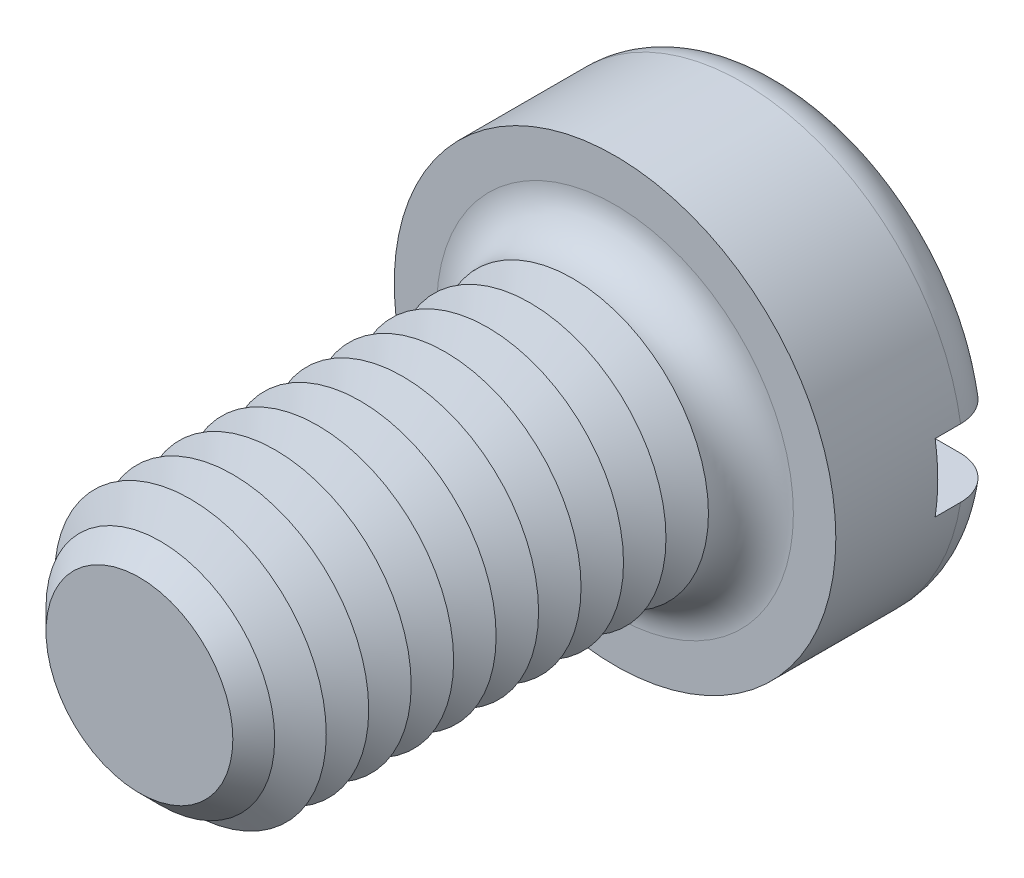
ISO-10303-21;
HEADER;
FILE_DESCRIPTION(('STEP AP214'),'2;1');
FILE_NAME('part.step','',(''),(''),'','','');
FILE_SCHEMA(('AUTOMOTIVE_DESIGN { 1 0 10303 214 1 1 1 1 }'));
ENDSEC;
DATA;
#1=APPLICATION_CONTEXT('core data for automotive mechanical design processes');
#2=APPLICATION_PROTOCOL_DEFINITION('international standard','automotive_design',2000,#1);
#3=PRODUCT_CONTEXT('',#1,'mechanical');
#4=PRODUCT('Part','Part','',(#3));
#5=PRODUCT_RELATED_PRODUCT_CATEGORY('part','',(#4));
#6=PRODUCT_DEFINITION_FORMATION('','',#4);
#7=PRODUCT_DEFINITION_CONTEXT('part definition',#1,'design');
#8=PRODUCT_DEFINITION('design','',#6,#7);
#9=PRODUCT_DEFINITION_SHAPE('','',#8);
#10=(LENGTH_UNIT() NAMED_UNIT(*) SI_UNIT(.MILLI.,.METRE.));
#11=(NAMED_UNIT(*) PLANE_ANGLE_UNIT() SI_UNIT($,.RADIAN.));
#12=(NAMED_UNIT(*) SI_UNIT($,.STERADIAN.) SOLID_ANGLE_UNIT());
#13=UNCERTAINTY_MEASURE_WITH_UNIT(LENGTH_MEASURE(1.E-05),#10,'distance_accuracy_value','');
#14=(GEOMETRIC_REPRESENTATION_CONTEXT(3) GLOBAL_UNCERTAINTY_ASSIGNED_CONTEXT((#13)) GLOBAL_UNIT_ASSIGNED_CONTEXT((#10,
#11,#12)) REPRESENTATION_CONTEXT('',''));
#15=CARTESIAN_POINT('',(0.,0.,0.));
#16=DIRECTION('',(0.,0.,1.));
#17=DIRECTION('',(1.,0.,0.));
#18=AXIS2_PLACEMENT_3D('',#15,#16,#17);
#19=CARTESIAN_POINT('',(0.,0.,-5.));
#20=DIRECTION('',(0.,0.,1.));
#21=DIRECTION('',(1.,0.,0.));
#22=AXIS2_PLACEMENT_3D('',#19,#20,#21);
#23=PLANE('',#22);
#24=CARTESIAN_POINT('',(0.,0.,-5.));
#25=DIRECTION('',(0.,0.,1.));
#26=DIRECTION('',(1.,0.,0.));
#27=AXIS2_PLACEMENT_3D('',#24,#25,#26);
#28=CIRCLE('',#27,5.25);
#29=CARTESIAN_POINT('',(-5.15388203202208,1.,-5.));
#30=VERTEX_POINT('',#29);
#31=CARTESIAN_POINT('',(5.15388203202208,1.,-5.));
#32=VERTEX_POINT('',#31);
#33=EDGE_CURVE('E116',#30,#32,#28,.F.);
#34=ORIENTED_EDGE('',*,*,#33,.T.);
#35=DIRECTION('',(1.,0.,0.));
#36=VECTOR('',#35,1.);
#37=CARTESIAN_POINT('',(-6.5,1.,-5.));
#38=LINE('',#37,#36);
#39=EDGE_CURVE('E111',#30,#32,#38,.T.);
#40=ORIENTED_EDGE('',*,*,#39,.F.);
#41=EDGE_LOOP('',(#34,#40));
#42=FACE_BOUND('',#41,.T.);
#43=ADVANCED_FACE('F39',(#42),#23,.F.);
#44=CARTESIAN_POINT('',(0.,0.,-3.75));
#45=DIRECTION('',(0.,0.,1.));
#46=DIRECTION('',(1.,0.,0.));
#47=AXIS2_PLACEMENT_3D('',#44,#45,#46);
#48=TOROIDAL_SURFACE('',#47,5.25,1.25);
#49=CARTESIAN_POINT('',(-6.04655789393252,1.,-4.63904490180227));
#50=CARTESIAN_POINT('',(-5.99546860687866,1.,-4.68885774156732));
#51=CARTESIAN_POINT('',(-5.94008472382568,1.,-4.73434760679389));
#52=CARTESIAN_POINT('',(-5.8223927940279,1.,-4.81538052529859));
#53=CARTESIAN_POINT('',(-5.7600753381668,1.,-4.85090982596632));
#54=CARTESIAN_POINT('',(-5.63044351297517,1.,-4.91100606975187));
#55=CARTESIAN_POINT('',(-5.56313479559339,1.,-4.93558519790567));
#56=CARTESIAN_POINT('',(-5.42539577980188,1.,-4.97322457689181));
#57=CARTESIAN_POINT('',(-5.35496625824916,1.,-4.98628767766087));
#58=CARTESIAN_POINT('',(-5.21212635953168,1.,-5.00070478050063));
#59=CARTESIAN_POINT('',(-5.13970265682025,1.,-5.00192674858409));
#60=CARTESIAN_POINT('',(-4.99565121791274,1.,-4.99234085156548));
#61=CARTESIAN_POINT('',(-4.92402357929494,1.,-4.98153152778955));
#62=CARTESIAN_POINT('',(-4.78274786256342,1.,-4.94801424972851));
#63=CARTESIAN_POINT('',(-4.71313137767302,1.,-4.92517296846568));
#64=CARTESIAN_POINT('',(-4.57871041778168,1.,-4.86813760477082));
#65=CARTESIAN_POINT('',(-4.51390612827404,1.,-4.83394308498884));
#66=CARTESIAN_POINT('',(-4.39095493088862,1.,-4.75508341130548));
#67=CARTESIAN_POINT('',(-4.33281197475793,1.,-4.7104120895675));
#68=CARTESIAN_POINT('',(-4.22499800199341,1.,-4.61179869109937));
#69=CARTESIAN_POINT('',(-4.17532640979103,1.,-4.55785724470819));
#70=CARTESIAN_POINT('',(-4.08677450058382,1.,-4.4431082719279));
#71=CARTESIAN_POINT('',(-4.0477350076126,1.,-4.38242369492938));
#72=CARTESIAN_POINT('',(-3.98074296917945,1.,-4.25521412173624));
#73=CARTESIAN_POINT('',(-3.95278836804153,1.,-4.18869021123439));
#74=CARTESIAN_POINT('',(-3.90959497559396,1.,-4.0537026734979));
#75=CARTESIAN_POINT('',(-3.89401985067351,1.,-3.98534663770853));
#76=CARTESIAN_POINT('',(-3.8748586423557,1.,-3.84697740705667));
#77=CARTESIAN_POINT('',(-3.87127067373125,1.,-3.7769644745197));
#78=CARTESIAN_POINT('',(-3.8761573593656,1.,-3.63892215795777));
#79=CARTESIAN_POINT('',(-3.88436651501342,1.,-3.57088319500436));
#80=CARTESIAN_POINT('',(-3.91207743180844,1.,-3.43714958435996));
#81=CARTESIAN_POINT('',(-3.93157911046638,1.,-3.37145491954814));
#82=CARTESIAN_POINT('',(-3.98125045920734,1.,-3.24411474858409));
#83=CARTESIAN_POINT('',(-4.01143761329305,1.,-3.18247607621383));
#84=CARTESIAN_POINT('',(-4.08150210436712,1.,-3.064981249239));
#85=CARTESIAN_POINT('',(-4.12138048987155,1.,-3.0091257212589));
#86=CARTESIAN_POINT('',(-4.2106718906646,1.,-2.90336353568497));
#87=CARTESIAN_POINT('',(-4.26028693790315,1.,-2.85362751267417));
#88=CARTESIAN_POINT('',(-4.36696587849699,1.,-2.76291710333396));
#89=CARTESIAN_POINT('',(-4.42403082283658,1.,-2.72194395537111));
#90=CARTESIAN_POINT('',(-4.54567957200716,1.,-2.64877280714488));
#91=CARTESIAN_POINT('',(-4.61042643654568,1.,-2.61684571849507));
#92=CARTESIAN_POINT('',(-4.74430563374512,1.,-2.56412359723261));
#93=CARTESIAN_POINT('',(-4.81343838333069,1.,-2.54332962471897));
#94=CARTESIAN_POINT('',(-4.95527237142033,1.,-2.51320471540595));
#95=CARTESIAN_POINT('',(-5.0280120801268,1.,-2.50405449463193));
#96=CARTESIAN_POINT('',(-5.17399775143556,1.,-2.49810126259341));
#97=CARTESIAN_POINT('',(-5.24724372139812,1.,-2.50129843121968));
#98=CARTESIAN_POINT('',(-5.3921014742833,1.,-2.52000776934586));
#99=CARTESIAN_POINT('',(-5.4637142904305,1.,-2.53551191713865));
#100=CARTESIAN_POINT('',(-5.60326680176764,1.,-2.57846304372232));
#101=CARTESIAN_POINT('',(-5.67120668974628,1.,-2.60590939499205));
#102=CARTESIAN_POINT('',(-5.80064060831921,1.,-2.67164926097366));
#103=CARTESIAN_POINT('',(-5.862199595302,1.,-2.7098148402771));
#104=CARTESIAN_POINT('',(-5.9779079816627,1.,-2.79608690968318));
#105=CARTESIAN_POINT('',(-6.03205795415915,1.,-2.84419263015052));
#106=CARTESIAN_POINT('',(-6.13055119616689,1.,-2.94820522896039));
#107=CARTESIAN_POINT('',(-6.17502887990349,1.,-3.00398483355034));
#108=CARTESIAN_POINT('',(-6.25384180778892,1.,-3.12230113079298));
#109=CARTESIAN_POINT('',(-6.28817779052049,1.,-3.18483733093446));
#110=CARTESIAN_POINT('',(-6.34527986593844,1.,-3.31401726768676));
#111=CARTESIAN_POINT('',(-6.36818984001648,1.,-3.38059742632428));
#112=CARTESIAN_POINT('',(-6.40240470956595,1.,-3.5166725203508));
#113=CARTESIAN_POINT('',(-6.41371067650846,1.,-3.58616718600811));
#114=CARTESIAN_POINT('',(-6.42433240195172,1.,-3.72550026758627));
#115=CARTESIAN_POINT('',(-6.4237441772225,1.,-3.79533138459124));
#116=CARTESIAN_POINT('',(-6.41082814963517,1.,-3.93391789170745));
#117=CARTESIAN_POINT('',(-6.39849757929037,1.,-4.00267302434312));
#118=CARTESIAN_POINT('',(-6.36249191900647,1.,-4.13704597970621));
#119=CARTESIAN_POINT('',(-6.33883072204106,1.,-4.20266753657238));
#120=CARTESIAN_POINT('',(-6.28088769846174,1.,-4.32897165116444));
#121=CARTESIAN_POINT('',(-6.24661890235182,1.,-4.38966015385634));
#122=CARTESIAN_POINT('',(-6.18404039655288,1.,-4.48163773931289));
#123=CARTESIAN_POINT('',(-6.15876600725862,1.,-4.51503333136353));
#124=CARTESIAN_POINT('',(-6.10500607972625,1.,-4.5791298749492));
#125=CARTESIAN_POINT('',(-6.07652056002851,1.,-4.60983084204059));
#126=CARTESIAN_POINT('',(-6.04655789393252,1.,-4.63904490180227));
#127=B_SPLINE_CURVE_WITH_KNOTS('',3,(#49,#50,#51,#52,#53,#54,#55,#56,#57,#58,#59,#60,#61,#62,
#63,#64,#65,#66,#67,#68,#69,#70,#71,#72,#73,#74,#75,#76,#77,#78,#79,#80,#81,#82,#83,#84,#85,#86,
#87,#88,#89,#90,#91,#92,#93,#94,#95,#96,#97,#98,#99,#100,#101,#102,#103,#104,#105,#106,#107,
#108,#109,#110,#111,#112,#113,#114,#115,#116,#117,#118,#119,#120,#121,#122,#123,#124,#125,#126),
.UNSPECIFIED.,.T.,.F.,(4,2,2,2,2,2,2,2,2,2,2,2,2,2,2,2,2,2,2,2,2,2,2,2,2,2,2,2,2,2,2,2,2,2,2,2,
2,2,4),(0.,0.213907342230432,0.428108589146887,0.642070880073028,0.855980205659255,
1.07227200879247,1.28859003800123,1.50735715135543,1.72613269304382,1.94503735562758,
2.16392713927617,2.37933295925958,2.59469881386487,2.80399176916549,3.01325180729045,
3.2178754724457,3.42249764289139,3.62745618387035,3.83243690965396,4.04223444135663,
4.25206160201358,4.46763253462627,4.68322399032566,4.90212226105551,5.12102372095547,
5.33978261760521,5.55853002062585,5.77477015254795,5.99099354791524,6.20398686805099,
6.41696467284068,6.62718821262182,6.83739233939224,7.0459002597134,7.25445733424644,
7.46275934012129,7.67080647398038,7.79625882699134,7.92171045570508),.UNSPECIFIED.);
#128=CARTESIAN_POINT('',(-6.42261628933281,1.,-3.74999999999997));
#129=VERTEX_POINT('',#128);
#130=EDGE_CURVE('E264',#129,#30,#127,.T.);
#131=ORIENTED_EDGE('',*,*,#130,.F.);
#132=CARTESIAN_POINT('',(0.,0.,-3.75));
#133=DIRECTION('',(0.,0.,1.));
#134=DIRECTION('',(1.,0.,0.));
#135=AXIS2_PLACEMENT_3D('',#132,#133,#134);
#136=CIRCLE('',#135,6.5);
#137=CARTESIAN_POINT('',(6.42261628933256,1.,-3.75));
#138=VERTEX_POINT('',#137);
#139=EDGE_CURVE('E125',#138,#129,#136,.T.);
#140=ORIENTED_EDGE('',*,*,#139,.F.);
#141=CARTESIAN_POINT('',(4.06944999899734,1.,-4.4133199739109));
#142=CARTESIAN_POINT('',(4.10828271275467,1.,-4.47354709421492));
#143=CARTESIAN_POINT('',(4.15233880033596,1.,-4.53047894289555));
#144=CARTESIAN_POINT('',(4.24946916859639,1.,-4.63614530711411));
#145=CARTESIAN_POINT('',(4.3025574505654,1.,-4.68486685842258));
#146=CARTESIAN_POINT('',(4.41603250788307,1.,-4.77271114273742));
#147=CARTESIAN_POINT('',(4.47640839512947,1.,-4.8118479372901));
#148=CARTESIAN_POINT('',(4.60277035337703,1.,-4.87959878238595));
#149=CARTESIAN_POINT('',(4.66875480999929,1.,-4.90821584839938));
#150=CARTESIAN_POINT('',(4.80558589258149,1.,-4.95456537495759));
#151=CARTESIAN_POINT('',(4.87649196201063,1.,-4.97212253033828));
#152=CARTESIAN_POINT('',(5.02024710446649,1.,-4.99514979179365));
#153=CARTESIAN_POINT('',(5.09309636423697,1.,-5.00061873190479));
#154=CARTESIAN_POINT('',(5.23902872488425,1.,-4.99926689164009));
#155=CARTESIAN_POINT('',(5.31211131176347,1.,-4.99238812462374));
#156=CARTESIAN_POINT('',(5.45605806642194,1.,-4.96635140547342));
#157=CARTESIAN_POINT('',(5.52692231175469,1.,-4.94719388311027));
#158=CARTESIAN_POINT('',(5.66376170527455,1.,-4.89728421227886));
#159=CARTESIAN_POINT('',(5.72977335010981,1.,-4.86663219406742));
#160=CARTESIAN_POINT('',(5.85560715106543,1.,-4.79452334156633));
#161=CARTESIAN_POINT('',(5.91542977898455,1.,-4.7530673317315));
#162=CARTESIAN_POINT('',(6.02626022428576,1.,-4.66116821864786));
#163=CARTESIAN_POINT('',(6.07738307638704,1.,-4.6108638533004));
#164=CARTESIAN_POINT('',(6.17030947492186,1.,-4.50227823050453));
#165=CARTESIAN_POINT('',(6.2121137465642,1.,-4.44399759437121));
#166=CARTESIAN_POINT('',(6.28460268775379,1.,-4.32200305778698));
#167=CARTESIAN_POINT('',(6.31543589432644,1.,-4.2583773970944));
#168=CARTESIAN_POINT('',(6.36586009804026,1.,-4.12681721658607));
#169=CARTESIAN_POINT('',(6.38545178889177,1.,-4.0588829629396));
#170=CARTESIAN_POINT('',(6.41265760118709,1.,-3.92136007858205));
#171=CARTESIAN_POINT('',(6.42038873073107,1.,-3.85179457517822));
#172=CARTESIAN_POINT('',(6.42401070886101,1.,-3.7123569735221));
#173=CARTESIAN_POINT('',(6.41990193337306,1.,-3.64248488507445));
#174=CARTESIAN_POINT('',(6.40000894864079,1.,-3.50470871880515));
#175=CARTESIAN_POINT('',(6.38427119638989,1.,-3.43679792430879));
#176=CARTESIAN_POINT('',(6.34164491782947,1.,-3.30457296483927));
#177=CARTESIAN_POINT('',(6.31475638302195,1.,-3.24025880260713));
#178=CARTESIAN_POINT('',(6.2505455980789,1.,-3.11686791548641));
#179=CARTESIAN_POINT('',(6.21319759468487,1.,-3.05780459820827));
#180=CARTESIAN_POINT('',(6.12919411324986,1.,-2.94671919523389));
#181=CARTESIAN_POINT('',(6.08253833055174,1.,-2.89469734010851));
#182=CARTESIAN_POINT('',(5.98083387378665,1.,-2.79868150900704));
#183=CARTESIAN_POINT('',(5.92571704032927,1.,-2.75475975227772));
#184=CARTESIAN_POINT('',(5.80897194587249,1.,-2.67665277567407));
#185=CARTESIAN_POINT('',(5.74734329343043,1.,-2.64246814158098));
#186=CARTESIAN_POINT('',(5.6184644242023,1.,-2.58431810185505));
#187=CARTESIAN_POINT('',(5.55115102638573,1.,-2.56049275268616));
#188=CARTESIAN_POINT('',(5.41351272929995,1.,-2.52429868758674));
#189=CARTESIAN_POINT('',(5.34318759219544,1.,-2.51193087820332));
#190=CARTESIAN_POINT('',(5.20041507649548,1.,-2.49882112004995));
#191=CARTESIAN_POINT('',(5.12795169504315,1.,-2.49825332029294));
#192=CARTESIAN_POINT('',(4.98393373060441,1.,-2.50914771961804));
#193=CARTESIAN_POINT('',(4.91237921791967,1.,-2.52061084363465));
#194=CARTESIAN_POINT('',(4.77137358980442,1.,-2.55542281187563));
#195=CARTESIAN_POINT('',(4.70195472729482,1.,-2.57890245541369));
#196=CARTESIAN_POINT('',(4.56803538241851,1.,-2.63717701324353));
#197=CARTESIAN_POINT('',(4.50353509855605,1.,-2.67197238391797));
#198=CARTESIAN_POINT('',(4.38131858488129,1.,-2.7519648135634));
#199=CARTESIAN_POINT('',(4.32360365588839,1.,-2.79716386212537));
#200=CARTESIAN_POINT('',(4.21673400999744,1.,-2.89675634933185));
#201=CARTESIAN_POINT('',(4.16757871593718,1.,-2.95114916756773));
#202=CARTESIAN_POINT('',(4.08014713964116,1.,-3.06667703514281));
#203=CARTESIAN_POINT('',(4.04170608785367,1.,-3.12768727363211));
#204=CARTESIAN_POINT('',(3.97596192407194,1.,-3.25543782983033));
#205=CARTESIAN_POINT('',(3.94865624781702,1.,-3.32217682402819));
#206=CARTESIAN_POINT('',(3.9067737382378,1.,-3.45745603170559));
#207=CARTESIAN_POINT('',(3.89185707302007,1.,-3.52589108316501));
#208=CARTESIAN_POINT('',(3.87400755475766,1.,-3.66432360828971));
#209=CARTESIAN_POINT('',(3.87107601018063,1.,-3.73432125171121));
#210=CARTESIAN_POINT('',(3.8772387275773,1.,-3.87228267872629));
#211=CARTESIAN_POINT('',(3.88607933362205,1.,-3.94025811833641));
#212=CARTESIAN_POINT('',(3.91502769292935,1.,-4.07370133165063));
#213=CARTESIAN_POINT('',(3.93512131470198,1.,-4.1391721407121));
#214=CARTESIAN_POINT('',(3.9752037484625,1.,-4.23926719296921));
#215=CARTESIAN_POINT('',(3.99171171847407,1.,-4.27532618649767));
#216=CARTESIAN_POINT('',(4.02809737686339,1.,-4.34569933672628));
#217=CARTESIAN_POINT('',(4.04797497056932,1.,-4.3800135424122));
#218=CARTESIAN_POINT('',(4.06944999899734,1.,-4.4133199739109));
#219=B_SPLINE_CURVE_WITH_KNOTS('',3,(#141,#142,#143,#144,#145,#146,#147,#148,#149,#150,#151,
#152,#153,#154,#155,#156,#157,#158,#159,#160,#161,#162,#163,#164,#165,#166,#167,#168,#169,#170,
#171,#172,#173,#174,#175,#176,#177,#178,#179,#180,#181,#182,#183,#184,#185,#186,#187,#188,#189,
#190,#191,#192,#193,#194,#195,#196,#197,#198,#199,#200,#201,#202,#203,#204,#205,#206,#207,#208,
#209,#210,#211,#212,#213,#214,#215,#216,#217,#218),.UNSPECIFIED.,.T.,.F.,(4,2,2,2,2,2,2,2,2,2,2,
2,2,2,2,2,2,2,2,2,2,2,2,2,2,2,2,2,2,2,2,2,2,2,2,2,2,2,4),(0.,0.214833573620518,
0.430003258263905,0.644855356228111,0.859645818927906,1.0777603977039,1.29589601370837,
1.51505870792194,1.73421373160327,1.95150241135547,2.16877451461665,2.38290237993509,
2.59701357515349,2.8081044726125,3.01918234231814,3.22816416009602,3.43713934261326,
3.64528416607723,3.85342914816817,4.06209119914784,4.27076008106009,4.48120788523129,
4.69166834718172,4.90489186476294,5.11813225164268,5.33451752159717,5.55091942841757,
5.76972860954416,5.98854661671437,6.20740650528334,6.42625163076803,6.64151774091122,
6.85673425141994,7.0658317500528,7.27495207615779,7.47963858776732,7.68406862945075,
7.80287790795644,7.92168384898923),.UNSPECIFIED.);
#220=EDGE_CURVE('E266',#32,#138,#219,.T.);
#221=ORIENTED_EDGE('',*,*,#220,.F.);
#222=ORIENTED_EDGE('',*,*,#33,.F.);
#223=EDGE_LOOP('',(#131,#140,#221,#222));
#224=FACE_BOUND('',#223,.T.);
#225=ADVANCED_FACE('F248',(#224),#48,.T.);
#226=CARTESIAN_POINT('',(0.,0.,-5.));
#227=DIRECTION('',(0.,0.,1.));
#228=DIRECTION('',(1.,0.,0.));
#229=AXIS2_PLACEMENT_3D('',#226,#227,#228);
#230=CYLINDRICAL_SURFACE('',#229,6.5);
#231=DIRECTION('',(0.,0.,1.));
#232=VECTOR('',#231,1.);
#233=CARTESIAN_POINT('',(6.42261628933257,1.,-5.));
#234=LINE('',#233,#232);
#235=CARTESIAN_POINT('',(6.42261628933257,1.,-3.));
#236=VERTEX_POINT('',#235);
#237=EDGE_CURVE('E282',#138,#236,#234,.T.);
#238=ORIENTED_EDGE('',*,*,#237,.F.);
#239=ORIENTED_EDGE('',*,*,#139,.T.);
#240=DIRECTION('',(0.,0.,1.));
#241=VECTOR('',#240,1.);
#242=CARTESIAN_POINT('',(-6.42261628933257,1.,-5.));
#243=LINE('',#242,#241);
#244=CARTESIAN_POINT('',(-6.42261628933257,1.,-3.));
#245=VERTEX_POINT('',#244);
#246=EDGE_CURVE('E63',#245,#129,#243,.F.);
#247=ORIENTED_EDGE('',*,*,#246,.F.);
#248=CARTESIAN_POINT('',(0.,0.,-3.));
#249=DIRECTION('',(0.,0.,-1.));
#250=DIRECTION('',(-1.,0.,0.));
#251=AXIS2_PLACEMENT_3D('',#248,#249,#250);
#252=CIRCLE('',#251,6.5);
#253=CARTESIAN_POINT('',(-6.42261628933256,-0.999999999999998,-3.));
#254=VERTEX_POINT('',#253);
#255=EDGE_CURVE('E43',#245,#254,#252,.F.);
#256=ORIENTED_EDGE('',*,*,#255,.T.);
#257=DIRECTION('',(0.,0.,1.));
#258=VECTOR('',#257,1.);
#259=CARTESIAN_POINT('',(-6.42261628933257,-0.999999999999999,-5.));
#260=LINE('',#259,#258);
#261=CARTESIAN_POINT('',(-6.42261628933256,-0.999999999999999,-3.75));
#262=VERTEX_POINT('',#261);
#263=EDGE_CURVE('E279',#262,#254,#260,.T.);
#264=ORIENTED_EDGE('',*,*,#263,.F.);
#265=CARTESIAN_POINT('',(6.42261628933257,-1.,-3.75));
#266=VERTEX_POINT('',#265);
#267=EDGE_CURVE('E127',#262,#266,#136,.T.);
#268=ORIENTED_EDGE('',*,*,#267,.T.);
#269=DIRECTION('',(0.,0.,1.));
#270=VECTOR('',#269,1.);
#271=CARTESIAN_POINT('',(6.42261628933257,-1.,-5.));
#272=LINE('',#271,#270);
#273=CARTESIAN_POINT('',(6.42261628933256,-1.,-3.));
#274=VERTEX_POINT('',#273);
#275=EDGE_CURVE('E55',#274,#266,#272,.F.);
#276=ORIENTED_EDGE('',*,*,#275,.F.);
#277=EDGE_CURVE('E11',#274,#236,#252,.F.);
#278=ORIENTED_EDGE('',*,*,#277,.T.);
#279=EDGE_LOOP('',(#238,#239,#247,#256,#264,#268,#276,#278));
#280=FACE_BOUND('',#279,.T.);
#281=CARTESIAN_POINT('',(0.,0.,0.));
#282=DIRECTION('',(0.,0.,1.));
#283=DIRECTION('',(1.,0.,0.));
#284=AXIS2_PLACEMENT_3D('',#281,#282,#283);
#285=CIRCLE('',#284,6.5);
#286=CARTESIAN_POINT('',(6.5,0.,0.));
#287=VERTEX_POINT('',#286);
#288=EDGE_CURVE('E285',#287,#287,#285,.T.);
#289=ORIENTED_EDGE('',*,*,#288,.F.);
#290=EDGE_LOOP('',(#289));
#291=FACE_BOUND('',#290,.T.);
#292=ADVANCED_FACE('F244',(#280,#291),#230,.T.);
#293=CARTESIAN_POINT('',(5.15388203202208,-1.,-5.));
#294=VERTEX_POINT('',#293);
#295=CARTESIAN_POINT('',(-5.15388203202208,-0.999999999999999,-5.));
#296=VERTEX_POINT('',#295);
#297=EDGE_CURVE('E109',#294,#296,#28,.F.);
#298=ORIENTED_EDGE('',*,*,#297,.T.);
#299=DIRECTION('',(-1.,0.,0.));
#300=VECTOR('',#299,1.);
#301=CARTESIAN_POINT('',(-6.5,-0.999999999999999,-5.));
#302=LINE('',#301,#300);
#303=EDGE_CURVE('E96',#294,#296,#302,.T.);
#304=ORIENTED_EDGE('',*,*,#303,.F.);
#305=EDGE_LOOP('',(#298,#304));
#306=FACE_BOUND('',#305,.T.);
#307=ADVANCED_FACE('F108',(#306),#23,.F.);
#308=CARTESIAN_POINT('',(0.,0.,0.));
#309=DIRECTION('',(0.,0.,1.));
#310=DIRECTION('',(1.,0.,0.));
#311=AXIS2_PLACEMENT_3D('',#308,#309,#310);
#312=PLANE('',#311);
#313=CARTESIAN_POINT('',(0.,0.,0.));
#314=DIRECTION('',(0.,0.,1.));
#315=DIRECTION('',(1.,0.,0.));
#316=AXIS2_PLACEMENT_3D('',#313,#314,#315);
#317=CIRCLE('',#316,5.25);
#318=CARTESIAN_POINT('',(5.25,0.,0.));
#319=VERTEX_POINT('',#318);
#320=EDGE_CURVE('E115',#319,#319,#317,.F.);
#321=ORIENTED_EDGE('',*,*,#320,.T.);
#322=EDGE_LOOP('',(#321));
#323=FACE_BOUND('',#322,.T.);
#324=ORIENTED_EDGE('',*,*,#288,.T.);
#325=EDGE_LOOP('',(#324));
#326=FACE_BOUND('',#325,.T.);
#327=ADVANCED_FACE('F243',(#323,#326),#312,.T.);
#328=CARTESIAN_POINT('',(-6.04655789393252,-0.999999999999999,-4.63904490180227));
#329=CARTESIAN_POINT('',(-6.0966604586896,-0.999999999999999,-4.59018532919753));
#330=CARTESIAN_POINT('',(-6.14270501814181,-0.999999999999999,-4.53709744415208));
#331=CARTESIAN_POINT('',(-6.22528519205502,-0.999999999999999,-4.42391631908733));
#332=CARTESIAN_POINT('',(-6.26181074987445,-0.999999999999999,-4.36381576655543));
#333=CARTESIAN_POINT('',(-6.32422109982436,-0.999999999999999,-4.23831836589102));
#334=CARTESIAN_POINT('',(-6.35010658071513,-0.999999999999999,-4.17292186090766));
#335=CARTESIAN_POINT('',(-6.39044668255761,-0.999999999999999,-4.03870925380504));
#336=CARTESIAN_POINT('',(-6.40490396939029,-0.999999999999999,-3.96989395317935));
#337=CARTESIAN_POINT('',(-6.42190814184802,-0.999999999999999,-3.83122595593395));
#338=CARTESIAN_POINT('',(-6.4245257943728,-0.999999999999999,-3.76138193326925));
#339=CARTESIAN_POINT('',(-6.41796432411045,-0.999999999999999,-3.62224935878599));
#340=CARTESIAN_POINT('',(-6.40878509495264,-0.999999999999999,-3.55296081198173));
#341=CARTESIAN_POINT('',(-6.37894560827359,-0.999999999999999,-3.41709241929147));
#342=CARTESIAN_POINT('',(-6.35831520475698,-0.999999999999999,-3.35050601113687));
#343=CARTESIAN_POINT('',(-6.30620980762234,-0.999999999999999,-3.22172312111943));
#344=CARTESIAN_POINT('',(-6.2747347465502,-0.999999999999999,-3.15952666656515));
#345=CARTESIAN_POINT('',(-6.20172710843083,-0.999999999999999,-3.04101762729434));
#346=CARTESIAN_POINT('',(-6.16015622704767,-0.999999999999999,-2.98472864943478));
#347=CARTESIAN_POINT('',(-6.06823774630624,-0.999999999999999,-2.87984578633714));
#348=CARTESIAN_POINT('',(-6.01788981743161,-0.999999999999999,-2.83125219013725));
#349=CARTESIAN_POINT('',(-5.90933830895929,-0.999999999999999,-2.74262118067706));
#350=CARTESIAN_POINT('',(-5.85106338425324,-0.999999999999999,-2.70267117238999));
#351=CARTESIAN_POINT('',(-5.72870702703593,-0.999999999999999,-2.63296796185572));
#352=CARTESIAN_POINT('',(-5.66462521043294,-0.999999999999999,-2.6032154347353));
#353=CARTESIAN_POINT('',(-5.53153273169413,-0.999999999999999,-2.55430842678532));
#354=CARTESIAN_POINT('',(-5.46246626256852,-0.999999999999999,-2.53530583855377));
#355=CARTESIAN_POINT('',(-5.32214267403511,-0.999999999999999,-2.5089831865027));
#356=CARTESIAN_POINT('',(-5.25088537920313,-0.999999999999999,-2.50166406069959));
#357=CARTESIAN_POINT('',(-5.10710123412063,-0.999999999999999,-2.49882202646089));
#358=CARTESIAN_POINT('',(-5.03457095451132,-0.999999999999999,-2.50347166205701));
#359=CARTESIAN_POINT('',(-4.8912897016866,-0.999999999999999,-2.52476029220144));
#360=CARTESIAN_POINT('',(-4.82053886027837,-0.999999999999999,-2.54140017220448));
#361=CARTESIAN_POINT('',(-4.68213257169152,-0.999999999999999,-2.58641614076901));
#362=CARTESIAN_POINT('',(-4.61451256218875,-0.999999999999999,-2.61490131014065));
#363=CARTESIAN_POINT('',(-4.48502801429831,-0.999999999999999,-2.68285095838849));
#364=CARTESIAN_POINT('',(-4.42316359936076,-0.999999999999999,-2.72231567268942));
#365=CARTESIAN_POINT('',(-4.30720694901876,-0.999999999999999,-2.81103994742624));
#366=CARTESIAN_POINT('',(-4.25309118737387,-0.999999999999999,-2.86026872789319));
#367=CARTESIAN_POINT('',(-4.15409408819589,-0.999999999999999,-2.9672764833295));
#368=CARTESIAN_POINT('',(-4.10921182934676,-0.999999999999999,-3.02505460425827));
#369=CARTESIAN_POINT('',(-4.03096584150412,-0.999999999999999,-3.14632492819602));
#370=CARTESIAN_POINT('',(-3.99739097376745,-0.999999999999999,-3.2096807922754));
#371=CARTESIAN_POINT('',(-3.94171839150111,-0.999999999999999,-3.34124912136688));
#372=CARTESIAN_POINT('',(-3.91961840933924,-0.999999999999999,-3.40946062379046));
#373=CARTESIAN_POINT('',(-3.88816636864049,-0.999999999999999,-3.54669256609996));
#374=CARTESIAN_POINT('',(-3.87846562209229,-0.999999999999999,-3.61563318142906));
#375=CARTESIAN_POINT('',(-3.87100568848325,-0.999999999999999,-3.75415397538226));
#376=CARTESIAN_POINT('',(-3.87324501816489,-0.999999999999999,-3.82373407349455));
#377=CARTESIAN_POINT('',(-3.88943589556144,-0.999999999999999,-3.96027701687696));
#378=CARTESIAN_POINT('',(-3.90318225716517,-0.999999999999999,-4.0272643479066));
#379=CARTESIAN_POINT('',(-3.94163954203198,-0.999999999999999,-4.1580093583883));
#380=CARTESIAN_POINT('',(-3.96635075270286,-0.999999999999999,-4.22176695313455));
#381=CARTESIAN_POINT('',(-4.026160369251,-0.999999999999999,-4.34483320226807));
#382=CARTESIAN_POINT('',(-4.06134035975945,-0.999999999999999,-4.40410214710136));
#383=CARTESIAN_POINT('',(-4.14090865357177,-0.999999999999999,-4.51609417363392));
#384=CARTESIAN_POINT('',(-4.18529811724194,-0.999999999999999,-4.56881642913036));
#385=CARTESIAN_POINT('',(-4.2832649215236,-0.999999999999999,-4.66770177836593));
#386=CARTESIAN_POINT('',(-4.33705327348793,-0.999999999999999,-4.71365579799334));
#387=CARTESIAN_POINT('',(-4.45141776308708,-0.999999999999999,-4.79615385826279));
#388=CARTESIAN_POINT('',(-4.51199483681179,-0.999999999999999,-4.83269659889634));
#389=CARTESIAN_POINT('',(-4.63989216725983,-0.999999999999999,-4.89626962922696));
#390=CARTESIAN_POINT('',(-4.70734508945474,-0.999999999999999,-4.92303326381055));
#391=CARTESIAN_POINT('',(-4.84575497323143,-0.999999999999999,-4.96500199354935));
#392=CARTESIAN_POINT('',(-4.91671207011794,-0.999999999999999,-4.98020664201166));
#393=CARTESIAN_POINT('',(-5.06097761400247,-0.999999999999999,-4.9987306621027));
#394=CARTESIAN_POINT('',(-5.13430353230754,-0.999999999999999,-5.00191441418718));
#395=CARTESIAN_POINT('',(-5.28046546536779,-0.999999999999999,-4.99587686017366));
#396=CARTESIAN_POINT('',(-5.35330135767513,-0.999999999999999,-4.98665256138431));
#397=CARTESIAN_POINT('',(-5.49610354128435,-0.999999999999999,-4.95604184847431));
#398=CARTESIAN_POINT('',(-5.56607890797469,-0.999999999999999,-4.93469772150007));
#399=CARTESIAN_POINT('',(-5.70131538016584,-0.999999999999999,-4.88041956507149));
#400=CARTESIAN_POINT('',(-5.76658233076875,-0.999999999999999,-4.84750021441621));
#401=CARTESIAN_POINT('',(-5.86782577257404,-0.999999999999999,-4.78498748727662));
#402=CARTESIAN_POINT('',(-5.90579749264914,-0.999999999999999,-4.75856648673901));
#403=CARTESIAN_POINT('',(-5.97862186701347,-0.999999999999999,-4.70172646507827));
#404=CARTESIAN_POINT('',(-6.0134745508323,-0.999999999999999,-4.6713074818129));
#405=CARTESIAN_POINT('',(-6.04655789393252,-0.999999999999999,-4.63904490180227));
#406=B_SPLINE_CURVE_WITH_KNOTS('',3,(#328,#329,#330,#331,#332,#333,#334,#335,#336,#337,#338,
#339,#340,#341,#342,#343,#344,#345,#346,#347,#348,#349,#350,#351,#352,#353,#354,#355,#356,#357,
#358,#359,#360,#361,#362,#363,#364,#365,#366,#367,#368,#369,#370,#371,#372,#373,#374,#375,#376,
#377,#378,#379,#380,#381,#382,#383,#384,#385,#386,#387,#388,#389,#390,#391,#392,#393,#394,#395,
#396,#397,#398,#399,#400,#401,#402,#403,#404,#405),.UNSPECIFIED.,.T.,.F.,(4,2,2,2,2,2,2,2,2,2,2,
2,2,2,2,2,2,2,2,2,2,2,2,2,2,2,2,2,2,2,2,2,2,2,2,2,2,2,4),(0.,0.209780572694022,
0.419781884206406,0.629769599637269,0.839708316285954,1.04839053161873,1.2570746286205,
1.46521720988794,1.67336108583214,1.88230736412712,2.09126148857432,2.30223890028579,
2.51323027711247,2.72713284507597,2.94105258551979,3.15807345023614,3.37511034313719,
3.59419176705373,3.81327788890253,4.03168404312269,4.25006839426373,4.46411376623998,
4.67811682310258,4.88595885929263,5.09377507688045,5.29796268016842,5.50215563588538,
5.70798353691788,5.91383738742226,6.12510741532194,6.33640661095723,6.55309998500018,
6.76980173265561,6.98894112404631,7.20813337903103,7.42656551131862,7.64472163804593,
7.78324365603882,7.92176436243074),.UNSPECIFIED.);
#407=EDGE_CURVE('E103',#296,#262,#406,.T.);
#408=ORIENTED_EDGE('',*,*,#407,.F.);
#409=ORIENTED_EDGE('',*,*,#297,.F.);
#410=CARTESIAN_POINT('',(4.06944999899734,-1.,-4.4133199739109));
#411=CARTESIAN_POINT('',(4.03213207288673,-1.,-4.3554312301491));
#412=CARTESIAN_POINT('',(3.9995849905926,-1.,-4.29441722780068));
#413=CARTESIAN_POINT('',(3.94511822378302,-1.,-4.16776604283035));
#414=CARTESIAN_POINT('',(3.92320762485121,-1.,-4.10212496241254));
#415=CARTESIAN_POINT('',(3.89078811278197,-1.,-3.96804412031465));
#416=CARTESIAN_POINT('',(3.88028409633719,-1.,-3.89960316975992));
#417=CARTESIAN_POINT('',(3.87107895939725,-1.,-3.76194650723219));
#418=CARTESIAN_POINT('',(3.87237511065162,-1.,-3.69273097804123));
#419=CARTESIAN_POINT('',(3.88662927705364,-1.,-3.55634460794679));
#420=CARTESIAN_POINT('',(3.89944923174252,-1.,-3.48915926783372));
#421=CARTESIAN_POINT('',(3.93611188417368,-1.,-3.35786953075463));
#422=CARTESIAN_POINT('',(3.95995518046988,-1.,-3.29376530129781));
#423=CARTESIAN_POINT('',(4.0180748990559,-1.,-3.16993562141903));
#424=CARTESIAN_POINT('',(4.05242297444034,-1.,-3.11024385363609));
#425=CARTESIAN_POINT('',(4.13041121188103,-1.,-2.9972793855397));
#426=CARTESIAN_POINT('',(4.17405248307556,-1.,-2.94400745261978));
#427=CARTESIAN_POINT('',(4.27058636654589,-1.,-2.8439150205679));
#428=CARTESIAN_POINT('',(4.32368948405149,-1.,-2.79729757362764));
#429=CARTESIAN_POINT('',(4.43679856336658,-1.,-2.71336600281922));
#430=CARTESIAN_POINT('',(4.49680546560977,-1.,-2.67605314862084));
#431=CARTESIAN_POINT('',(4.62370121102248,-1.,-2.61081752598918));
#432=CARTESIAN_POINT('',(4.69072799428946,-1.,-2.58316284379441));
#433=CARTESIAN_POINT('',(4.82843981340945,-1.,-2.5393441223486));
#434=CARTESIAN_POINT('',(4.899125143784,-1.,-2.52318100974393));
#435=CARTESIAN_POINT('',(5.04306377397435,-1.,-2.50267755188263));
#436=CARTESIAN_POINT('',(5.11633773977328,-1.,-2.49848181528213));
#437=CARTESIAN_POINT('',(5.26254809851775,-1.,-2.50249357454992));
#438=CARTESIAN_POINT('',(5.33548449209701,-1.,-2.51070104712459));
#439=CARTESIAN_POINT('',(5.4786703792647,-1.,-2.53930888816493));
#440=CARTESIAN_POINT('',(5.54892819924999,-1.,-2.5596675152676));
#441=CARTESIAN_POINT('',(5.68495799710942,-1.,-2.61204238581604));
#442=CARTESIAN_POINT('',(5.75073024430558,-1.,-2.64405792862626));
#443=CARTESIAN_POINT('',(5.8750178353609,-1.,-2.7184150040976));
#444=CARTESIAN_POINT('',(5.93361487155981,-1.,-2.76061995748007));
#445=CARTESIAN_POINT('',(6.04275377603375,-1.,-2.85440601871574));
#446=CARTESIAN_POINT('',(6.09329629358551,-1.,-2.90598637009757));
#447=CARTESIAN_POINT('',(6.18409572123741,-1.,-3.01622977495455));
#448=CARTESIAN_POINT('',(6.2244945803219,-1.,-3.07477592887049));
#449=CARTESIAN_POINT('',(6.29474798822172,-1.,-3.19788594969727));
#450=CARTESIAN_POINT('',(6.3246032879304,-1.,-3.26244938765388));
#451=CARTESIAN_POINT('',(6.37256001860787,-1.,-3.39491634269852));
#452=CARTESIAN_POINT('',(6.39079949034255,-1.,-3.46276990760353));
#453=CARTESIAN_POINT('',(6.41554133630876,-1.,-3.60058363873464));
#454=CARTESIAN_POINT('',(6.42204424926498,-1.,-3.67054370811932));
#455=CARTESIAN_POINT('',(6.42311237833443,-1.,-3.81007982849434));
#456=CARTESIAN_POINT('',(6.41775799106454,-1.,-3.879655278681));
#457=CARTESIAN_POINT('',(6.39543799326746,-1.,-4.01691664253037));
#458=CARTESIAN_POINT('',(6.3784725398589,-1.,-4.08460258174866));
#459=CARTESIAN_POINT('',(6.33344768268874,-1.,-4.21614537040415));
#460=CARTESIAN_POINT('',(6.30539273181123,-1.,-4.28000374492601));
#461=CARTESIAN_POINT('',(6.23902076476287,-1.,-4.40214140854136));
#462=CARTESIAN_POINT('',(6.20070356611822,-1.,-4.46042059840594));
#463=CARTESIAN_POINT('',(6.11467174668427,-1.,-4.5701315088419));
#464=CARTESIAN_POINT('',(6.06690270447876,-1.,-4.62152053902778));
#465=CARTESIAN_POINT('',(5.96350111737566,-1.,-4.715657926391));
#466=CARTESIAN_POINT('',(5.90786817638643,-1.,-4.75840584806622));
#467=CARTESIAN_POINT('',(5.78965380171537,-1.,-4.8345781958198));
#468=CARTESIAN_POINT('',(5.72700078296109,-1.,-4.86789149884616));
#469=CARTESIAN_POINT('',(5.59704977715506,-1.,-4.92369754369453));
#470=CARTESIAN_POINT('',(5.52975144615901,-1.,-4.94618948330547));
#471=CARTESIAN_POINT('',(5.39137621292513,-1.,-4.98006173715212));
#472=CARTESIAN_POINT('',(5.32025859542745,-1.,-4.99127571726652));
#473=CARTESIAN_POINT('',(5.17715081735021,-1.,-5.00177798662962));
#474=CARTESIAN_POINT('',(5.10516061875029,-1.,-5.00106575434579));
#475=CARTESIAN_POINT('',(4.96131924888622,-1.,-4.98769775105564));
#476=CARTESIAN_POINT('',(4.88948297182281,-1.,-4.97488146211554));
#477=CARTESIAN_POINT('',(4.74893184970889,-1.,-4.93744335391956));
#478=CARTESIAN_POINT('',(4.68021795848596,-1.,-4.91281795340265));
#479=CARTESIAN_POINT('',(4.54744428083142,-1.,-4.8522329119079));
#480=CARTESIAN_POINT('',(4.48341761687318,-1.,-4.81620070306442));
#481=CARTESIAN_POINT('',(4.36244497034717,-1.,-4.73383277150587));
#482=CARTESIAN_POINT('',(4.30549069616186,-1.,-4.68750929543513));
#483=CARTESIAN_POINT('',(4.21823158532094,-1.,-4.60311228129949));
#484=CARTESIAN_POINT('',(4.18544074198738,-1.,-4.56757118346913));
#485=CARTESIAN_POINT('',(4.12413461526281,-1.,-4.49297229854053));
#486=CARTESIAN_POINT('',(4.09561926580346,-1.,-4.45391456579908));
#487=CARTESIAN_POINT('',(4.06944999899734,-1.,-4.4133199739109));
#488=B_SPLINE_CURVE_WITH_KNOTS('',3,(#410,#411,#412,#413,#414,#415,#416,#417,#418,#419,#420,
#421,#422,#423,#424,#425,#426,#427,#428,#429,#430,#431,#432,#433,#434,#435,#436,#437,#438,#439,
#440,#441,#442,#443,#444,#445,#446,#447,#448,#449,#450,#451,#452,#453,#454,#455,#456,#457,#458,
#459,#460,#461,#462,#463,#464,#465,#466,#467,#468,#469,#470,#471,#472,#473,#474,#475,#476,#477,
#478,#479,#480,#481,#482,#483,#484,#485,#486,#487),.UNSPECIFIED.,.T.,.F.,(4,2,2,2,2,2,2,2,2,2,2,
2,2,2,2,2,2,2,2,2,2,2,2,2,2,2,2,2,2,2,2,2,2,2,2,2,2,2,4),(0.,0.206453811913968,0.4130836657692,
0.619802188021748,0.826472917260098,1.03070015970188,1.23493849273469,1.44060223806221,
1.64629054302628,1.85731119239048,2.06836062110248,2.28487349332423,2.5014038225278,
2.72053974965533,2.9396752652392,3.15806230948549,3.37643622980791,3.59203140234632,
3.80760918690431,4.01997696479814,4.23232961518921,4.44210913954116,4.65187903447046,
4.86023097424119,5.06858009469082,5.27684563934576,5.48511488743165,5.69462015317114,
5.90413597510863,6.11602561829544,6.32793096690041,6.54291770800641,6.75791385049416,
6.97580180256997,7.19375587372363,7.41312537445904,7.63223520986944,7.77701357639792,
7.92178970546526),.UNSPECIFIED.);
#489=EDGE_CURVE('E92',#266,#294,#488,.T.);
#490=ORIENTED_EDGE('',*,*,#489,.F.);
#491=ORIENTED_EDGE('',*,*,#267,.F.);
#492=EDGE_LOOP('',(#408,#409,#490,#491));
#493=FACE_BOUND('',#492,.T.);
#494=ADVANCED_FACE('F113',(#493),#48,.T.);
#495=CARTESIAN_POINT('',(0.,0.,1.25));
#496=DIRECTION('',(0.,0.,1.));
#497=DIRECTION('',(1.,0.,0.));
#498=AXIS2_PLACEMENT_3D('',#495,#496,#497);
#499=TOROIDAL_SURFACE('',#498,5.25,1.25);
#500=ORIENTED_EDGE('',*,*,#320,.F.);
#501=EDGE_LOOP('',(#500));
#502=FACE_BOUND('',#501,.T.);
#503=CARTESIAN_POINT('',(0.,0.,1.25));
#504=DIRECTION('',(0.,0.,-1.));
#505=DIRECTION('',(-1.,0.,0.));
#506=AXIS2_PLACEMENT_3D('',#503,#504,#505);
#507=CIRCLE('',#506,4.);
#508=CARTESIAN_POINT('',(-4.,0.,1.25));
#509=VERTEX_POINT('',#508);
#510=EDGE_CURVE('E291',#509,#509,#507,.T.);
#511=ORIENTED_EDGE('',*,*,#510,.T.);
#512=EDGE_LOOP('',(#511));
#513=FACE_BOUND('',#512,.T.);
#514=ADVANCED_FACE('F236',(#502,#513),#499,.F.);
#515=CARTESIAN_POINT('',(0.,0.,1.875));
#516=DIRECTION('',(0.,0.,-1.));
#517=DIRECTION('',(-1.,0.,0.));
#518=AXIS2_PLACEMENT_3D('',#515,#516,#517);
#519=CONICAL_SURFACE('',#518,2.91746824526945,1.0471975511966);
#520=ORIENTED_EDGE('',*,*,#510,.F.);
#521=EDGE_LOOP('',(#520));
#522=FACE_BOUND('',#521,.T.);
#523=CARTESIAN_POINT('',(0.,0.,1.875));
#524=DIRECTION('',(0.,0.,-1.));
#525=DIRECTION('',(-1.,0.,0.));
#526=AXIS2_PLACEMENT_3D('',#523,#524,#525);
#527=CIRCLE('',#526,2.91746824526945);
#528=CARTESIAN_POINT('',(-2.91746824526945,0.,1.875));
#529=VERTEX_POINT('',#528);
#530=EDGE_CURVE('E297',#529,#529,#527,.T.);
#531=ORIENTED_EDGE('',*,*,#530,.T.);
#532=EDGE_LOOP('',(#531));
#533=FACE_BOUND('',#532,.T.);
#534=ADVANCED_FACE('F232',(#522,#533),#519,.T.);
#535=CARTESIAN_POINT('',(0.,0.,2.5));
#536=DIRECTION('',(0.,0.,1.));
#537=DIRECTION('',(1.,0.,0.));
#538=AXIS2_PLACEMENT_3D('',#535,#536,#537);
#539=CONICAL_SURFACE('',#538,4.,1.0471975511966);
#540=ORIENTED_EDGE('',*,*,#530,.F.);
#541=EDGE_LOOP('',(#540));
#542=FACE_BOUND('',#541,.T.);
#543=CARTESIAN_POINT('',(0.,0.,2.5));
#544=DIRECTION('',(0.,0.,-1.));
#545=DIRECTION('',(-1.,0.,0.));
#546=AXIS2_PLACEMENT_3D('',#543,#544,#545);
#547=CIRCLE('',#546,4.);
#548=CARTESIAN_POINT('',(-4.,0.,2.5));
#549=VERTEX_POINT('',#548);
#550=EDGE_CURVE('E303',#549,#549,#547,.T.);
#551=ORIENTED_EDGE('',*,*,#550,.T.);
#552=EDGE_LOOP('',(#551));
#553=FACE_BOUND('',#552,.T.);
#554=ADVANCED_FACE('F228',(#542,#553),#539,.T.);
#555=CARTESIAN_POINT('',(0.,0.,3.125));
#556=DIRECTION('',(0.,0.,-1.));
#557=DIRECTION('',(-1.,0.,0.));
#558=AXIS2_PLACEMENT_3D('',#555,#556,#557);
#559=CONICAL_SURFACE('',#558,2.91746824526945,1.0471975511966);
#560=ORIENTED_EDGE('',*,*,#550,.F.);
#561=EDGE_LOOP('',(#560));
#562=FACE_BOUND('',#561,.T.);
#563=CARTESIAN_POINT('',(0.,0.,3.125));
#564=DIRECTION('',(0.,0.,-1.));
#565=DIRECTION('',(-1.,0.,0.));
#566=AXIS2_PLACEMENT_3D('',#563,#564,#565);
#567=CIRCLE('',#566,2.91746824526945);
#568=CARTESIAN_POINT('',(-2.91746824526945,0.,3.125));
#569=VERTEX_POINT('',#568);
#570=EDGE_CURVE('E307',#569,#569,#567,.T.);
#571=ORIENTED_EDGE('',*,*,#570,.T.);
#572=EDGE_LOOP('',(#571));
#573=FACE_BOUND('',#572,.T.);
#574=ADVANCED_FACE('F224',(#562,#573),#559,.T.);
#575=CARTESIAN_POINT('',(0.,0.,3.75));
#576=DIRECTION('',(0.,0.,1.));
#577=DIRECTION('',(1.,0.,0.));
#578=AXIS2_PLACEMENT_3D('',#575,#576,#577);
#579=CONICAL_SURFACE('',#578,4.,1.0471975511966);
#580=ORIENTED_EDGE('',*,*,#570,.F.);
#581=EDGE_LOOP('',(#580));
#582=FACE_BOUND('',#581,.T.);
#583=CARTESIAN_POINT('',(0.,0.,3.75));
#584=DIRECTION('',(0.,0.,-1.));
#585=DIRECTION('',(-1.,0.,0.));
#586=AXIS2_PLACEMENT_3D('',#583,#584,#585);
#587=CIRCLE('',#586,4.);
#588=CARTESIAN_POINT('',(-4.,0.,3.75));
#589=VERTEX_POINT('',#588);
#590=EDGE_CURVE('E311',#589,#589,#587,.T.);
#591=ORIENTED_EDGE('',*,*,#590,.T.);
#592=EDGE_LOOP('',(#591));
#593=FACE_BOUND('',#592,.T.);
#594=ADVANCED_FACE('F220',(#582,#593),#579,.T.);
#595=CARTESIAN_POINT('',(0.,0.,4.375));
#596=DIRECTION('',(0.,0.,-1.));
#597=DIRECTION('',(-1.,0.,0.));
#598=AXIS2_PLACEMENT_3D('',#595,#596,#597);
#599=CONICAL_SURFACE('',#598,2.91746824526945,1.0471975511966);
#600=ORIENTED_EDGE('',*,*,#590,.F.);
#601=EDGE_LOOP('',(#600));
#602=FACE_BOUND('',#601,.T.);
#603=CARTESIAN_POINT('',(0.,0.,4.375));
#604=DIRECTION('',(0.,0.,-1.));
#605=DIRECTION('',(-1.,0.,0.));
#606=AXIS2_PLACEMENT_3D('',#603,#604,#605);
#607=CIRCLE('',#606,2.91746824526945);
#608=CARTESIAN_POINT('',(-2.91746824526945,0.,4.375));
#609=VERTEX_POINT('',#608);
#610=EDGE_CURVE('E315',#609,#609,#607,.T.);
#611=ORIENTED_EDGE('',*,*,#610,.T.);
#612=EDGE_LOOP('',(#611));
#613=FACE_BOUND('',#612,.T.);
#614=ADVANCED_FACE('F216',(#602,#613),#599,.T.);
#615=CARTESIAN_POINT('',(0.,0.,5.));
#616=DIRECTION('',(0.,0.,1.));
#617=DIRECTION('',(1.,0.,0.));
#618=AXIS2_PLACEMENT_3D('',#615,#616,#617);
#619=CONICAL_SURFACE('',#618,4.,1.0471975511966);
#620=ORIENTED_EDGE('',*,*,#610,.F.);
#621=EDGE_LOOP('',(#620));
#622=FACE_BOUND('',#621,.T.);
#623=CARTESIAN_POINT('',(0.,0.,5.));
#624=DIRECTION('',(0.,0.,-1.));
#625=DIRECTION('',(-1.,0.,0.));
#626=AXIS2_PLACEMENT_3D('',#623,#624,#625);
#627=CIRCLE('',#626,4.);
#628=CARTESIAN_POINT('',(-4.,0.,5.));
#629=VERTEX_POINT('',#628);
#630=EDGE_CURVE('E319',#629,#629,#627,.T.);
#631=ORIENTED_EDGE('',*,*,#630,.T.);
#632=EDGE_LOOP('',(#631));
#633=FACE_BOUND('',#632,.T.);
#634=ADVANCED_FACE('F212',(#622,#633),#619,.T.);
#635=CARTESIAN_POINT('',(0.,0.,5.625));
#636=DIRECTION('',(0.,0.,-1.));
#637=DIRECTION('',(-1.,0.,0.));
#638=AXIS2_PLACEMENT_3D('',#635,#636,#637);
#639=CONICAL_SURFACE('',#638,2.91746824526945,1.0471975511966);
#640=ORIENTED_EDGE('',*,*,#630,.F.);
#641=EDGE_LOOP('',(#640));
#642=FACE_BOUND('',#641,.T.);
#643=CARTESIAN_POINT('',(0.,0.,5.625));
#644=DIRECTION('',(0.,0.,-1.));
#645=DIRECTION('',(-1.,0.,0.));
#646=AXIS2_PLACEMENT_3D('',#643,#644,#645);
#647=CIRCLE('',#646,2.91746824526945);
#648=CARTESIAN_POINT('',(-2.91746824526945,0.,5.625));
#649=VERTEX_POINT('',#648);
#650=EDGE_CURVE('E322',#649,#649,#647,.T.);
#651=ORIENTED_EDGE('',*,*,#650,.T.);
#652=EDGE_LOOP('',(#651));
#653=FACE_BOUND('',#652,.T.);
#654=ADVANCED_FACE('F208',(#642,#653),#639,.T.);
#655=CARTESIAN_POINT('',(0.,0.,6.25));
#656=DIRECTION('',(0.,0.,1.));
#657=DIRECTION('',(1.,0.,0.));
#658=AXIS2_PLACEMENT_3D('',#655,#656,#657);
#659=CONICAL_SURFACE('',#658,4.,1.0471975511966);
#660=ORIENTED_EDGE('',*,*,#650,.F.);
#661=EDGE_LOOP('',(#660));
#662=FACE_BOUND('',#661,.T.);
#663=CARTESIAN_POINT('',(0.,0.,6.25));
#664=DIRECTION('',(0.,0.,-1.));
#665=DIRECTION('',(-1.,0.,0.));
#666=AXIS2_PLACEMENT_3D('',#663,#664,#665);
#667=CIRCLE('',#666,4.);
#668=CARTESIAN_POINT('',(-4.,0.,6.25));
#669=VERTEX_POINT('',#668);
#670=EDGE_CURVE('E325',#669,#669,#667,.T.);
#671=ORIENTED_EDGE('',*,*,#670,.T.);
#672=EDGE_LOOP('',(#671));
#673=FACE_BOUND('',#672,.T.);
#674=ADVANCED_FACE('F204',(#662,#673),#659,.T.);
#675=CARTESIAN_POINT('',(0.,0.,6.875));
#676=DIRECTION('',(0.,0.,-1.));
#677=DIRECTION('',(-1.,0.,0.));
#678=AXIS2_PLACEMENT_3D('',#675,#676,#677);
#679=CONICAL_SURFACE('',#678,2.91746824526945,1.0471975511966);
#680=ORIENTED_EDGE('',*,*,#670,.F.);
#681=EDGE_LOOP('',(#680));
#682=FACE_BOUND('',#681,.T.);
#683=CARTESIAN_POINT('',(0.,0.,6.875));
#684=DIRECTION('',(0.,0.,-1.));
#685=DIRECTION('',(-1.,0.,0.));
#686=AXIS2_PLACEMENT_3D('',#683,#684,#685);
#687=CIRCLE('',#686,2.91746824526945);
#688=CARTESIAN_POINT('',(-2.91746824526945,0.,6.875));
#689=VERTEX_POINT('',#688);
#690=EDGE_CURVE('E329',#689,#689,#687,.T.);
#691=ORIENTED_EDGE('',*,*,#690,.T.);
#692=EDGE_LOOP('',(#691));
#693=FACE_BOUND('',#692,.T.);
#694=ADVANCED_FACE('F200',(#682,#693),#679,.T.);
#695=CARTESIAN_POINT('',(0.,0.,7.5));
#696=DIRECTION('',(0.,0.,1.));
#697=DIRECTION('',(1.,0.,0.));
#698=AXIS2_PLACEMENT_3D('',#695,#696,#697);
#699=CONICAL_SURFACE('',#698,4.,1.0471975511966);
#700=ORIENTED_EDGE('',*,*,#690,.F.);
#701=EDGE_LOOP('',(#700));
#702=FACE_BOUND('',#701,.T.);
#703=CARTESIAN_POINT('',(0.,0.,7.5));
#704=DIRECTION('',(0.,0.,-1.));
#705=DIRECTION('',(-1.,0.,0.));
#706=AXIS2_PLACEMENT_3D('',#703,#704,#705);
#707=CIRCLE('',#706,4.);
#708=CARTESIAN_POINT('',(-4.,0.,7.5));
#709=VERTEX_POINT('',#708);
#710=EDGE_CURVE('E332',#709,#709,#707,.T.);
#711=ORIENTED_EDGE('',*,*,#710,.T.);
#712=EDGE_LOOP('',(#711));
#713=FACE_BOUND('',#712,.T.);
#714=ADVANCED_FACE('F196',(#702,#713),#699,.T.);
#715=CARTESIAN_POINT('',(0.,0.,8.125));
#716=DIRECTION('',(0.,0.,-1.));
#717=DIRECTION('',(-1.,0.,0.));
#718=AXIS2_PLACEMENT_3D('',#715,#716,#717);
#719=CONICAL_SURFACE('',#718,2.91746824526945,1.0471975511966);
#720=ORIENTED_EDGE('',*,*,#710,.F.);
#721=EDGE_LOOP('',(#720));
#722=FACE_BOUND('',#721,.T.);
#723=CARTESIAN_POINT('',(0.,0.,8.125));
#724=DIRECTION('',(0.,0.,-1.));
#725=DIRECTION('',(-1.,0.,0.));
#726=AXIS2_PLACEMENT_3D('',#723,#724,#725);
#727=CIRCLE('',#726,2.91746824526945);
#728=CARTESIAN_POINT('',(-2.91746824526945,0.,8.125));
#729=VERTEX_POINT('',#728);
#730=EDGE_CURVE('E335',#729,#729,#727,.T.);
#731=ORIENTED_EDGE('',*,*,#730,.T.);
#732=EDGE_LOOP('',(#731));
#733=FACE_BOUND('',#732,.T.);
#734=ADVANCED_FACE('F192',(#722,#733),#719,.T.);
#735=CARTESIAN_POINT('',(0.,0.,8.75));
#736=DIRECTION('',(0.,0.,1.));
#737=DIRECTION('',(1.,0.,0.));
#738=AXIS2_PLACEMENT_3D('',#735,#736,#737);
#739=CONICAL_SURFACE('',#738,4.,1.0471975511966);
#740=ORIENTED_EDGE('',*,*,#730,.F.);
#741=EDGE_LOOP('',(#740));
#742=FACE_BOUND('',#741,.T.);
#743=CARTESIAN_POINT('',(0.,0.,8.75));
#744=DIRECTION('',(0.,0.,-1.));
#745=DIRECTION('',(-1.,0.,0.));
#746=AXIS2_PLACEMENT_3D('',#743,#744,#745);
#747=CIRCLE('',#746,4.);
#748=CARTESIAN_POINT('',(-4.,0.,8.75));
#749=VERTEX_POINT('',#748);
#750=EDGE_CURVE('E339',#749,#749,#747,.T.);
#751=ORIENTED_EDGE('',*,*,#750,.T.);
#752=EDGE_LOOP('',(#751));
#753=FACE_BOUND('',#752,.T.);
#754=ADVANCED_FACE('F188',(#742,#753),#739,.T.);
#755=CARTESIAN_POINT('',(0.,0.,9.375));
#756=DIRECTION('',(0.,0.,-1.));
#757=DIRECTION('',(-1.,0.,0.));
#758=AXIS2_PLACEMENT_3D('',#755,#756,#757);
#759=CONICAL_SURFACE('',#758,2.91746824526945,1.0471975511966);
#760=ORIENTED_EDGE('',*,*,#750,.F.);
#761=EDGE_LOOP('',(#760));
#762=FACE_BOUND('',#761,.T.);
#763=CARTESIAN_POINT('',(0.,0.,9.375));
#764=DIRECTION('',(0.,0.,-1.));
#765=DIRECTION('',(-1.,0.,0.));
#766=AXIS2_PLACEMENT_3D('',#763,#764,#765);
#767=CIRCLE('',#766,2.91746824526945);
#768=CARTESIAN_POINT('',(-2.91746824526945,0.,9.375));
#769=VERTEX_POINT('',#768);
#770=EDGE_CURVE('E343',#769,#769,#767,.T.);
#771=ORIENTED_EDGE('',*,*,#770,.T.);
#772=EDGE_LOOP('',(#771));
#773=FACE_BOUND('',#772,.T.);
#774=ADVANCED_FACE('F184',(#762,#773),#759,.T.);
#775=CARTESIAN_POINT('',(0.,0.,10.));
#776=DIRECTION('',(0.,0.,1.));
#777=DIRECTION('',(1.,0.,0.));
#778=AXIS2_PLACEMENT_3D('',#775,#776,#777);
#779=CONICAL_SURFACE('',#778,4.,1.0471975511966);
#780=ORIENTED_EDGE('',*,*,#770,.F.);
#781=EDGE_LOOP('',(#780));
#782=FACE_BOUND('',#781,.T.);
#783=CARTESIAN_POINT('',(0.,0.,10.));
#784=DIRECTION('',(0.,0.,-1.));
#785=DIRECTION('',(-1.,0.,0.));
#786=AXIS2_PLACEMENT_3D('',#783,#784,#785);
#787=CIRCLE('',#786,4.);
#788=CARTESIAN_POINT('',(-4.,0.,10.));
#789=VERTEX_POINT('',#788);
#790=EDGE_CURVE('E347',#789,#789,#787,.T.);
#791=ORIENTED_EDGE('',*,*,#790,.T.);
#792=EDGE_LOOP('',(#791));
#793=FACE_BOUND('',#792,.T.);
#794=ADVANCED_FACE('F180',(#782,#793),#779,.T.);
#795=CARTESIAN_POINT('',(0.,0.,10.625));
#796=DIRECTION('',(0.,0.,-1.));
#797=DIRECTION('',(-1.,0.,0.));
#798=AXIS2_PLACEMENT_3D('',#795,#796,#797);
#799=CONICAL_SURFACE('',#798,2.91746824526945,1.0471975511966);
#800=ORIENTED_EDGE('',*,*,#790,.F.);
#801=EDGE_LOOP('',(#800));
#802=FACE_BOUND('',#801,.T.);
#803=CARTESIAN_POINT('',(0.,0.,10.625));
#804=DIRECTION('',(0.,0.,-1.));
#805=DIRECTION('',(-1.,0.,0.));
#806=AXIS2_PLACEMENT_3D('',#803,#804,#805);
#807=CIRCLE('',#806,2.91746824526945);
#808=CARTESIAN_POINT('',(-2.91746824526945,0.,10.625));
#809=VERTEX_POINT('',#808);
#810=EDGE_CURVE('E350',#809,#809,#807,.T.);
#811=ORIENTED_EDGE('',*,*,#810,.T.);
#812=EDGE_LOOP('',(#811));
#813=FACE_BOUND('',#812,.T.);
#814=ADVANCED_FACE('F176',(#802,#813),#799,.T.);
#815=CARTESIAN_POINT('',(0.,0.,11.25));
#816=DIRECTION('',(0.,0.,1.));
#817=DIRECTION('',(1.,0.,0.));
#818=AXIS2_PLACEMENT_3D('',#815,#816,#817);
#819=CONICAL_SURFACE('',#818,4.,1.0471975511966);
#820=ORIENTED_EDGE('',*,*,#810,.F.);
#821=EDGE_LOOP('',(#820));
#822=FACE_BOUND('',#821,.T.);
#823=CARTESIAN_POINT('',(0.,0.,11.25));
#824=DIRECTION('',(0.,0.,-1.));
#825=DIRECTION('',(-1.,0.,0.));
#826=AXIS2_PLACEMENT_3D('',#823,#824,#825);
#827=CIRCLE('',#826,4.);
#828=CARTESIAN_POINT('',(-4.,0.,11.25));
#829=VERTEX_POINT('',#828);
#830=EDGE_CURVE('E353',#829,#829,#827,.T.);
#831=ORIENTED_EDGE('',*,*,#830,.T.);
#832=EDGE_LOOP('',(#831));
#833=FACE_BOUND('',#832,.T.);
#834=ADVANCED_FACE('F172',(#822,#833),#819,.T.);
#835=CARTESIAN_POINT('',(0.,0.,11.875));
#836=DIRECTION('',(0.,0.,-1.));
#837=DIRECTION('',(-1.,0.,0.));
#838=AXIS2_PLACEMENT_3D('',#835,#836,#837);
#839=CONICAL_SURFACE('',#838,2.91746824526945,1.0471975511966);
#840=ORIENTED_EDGE('',*,*,#830,.F.);
#841=EDGE_LOOP('',(#840));
#842=FACE_BOUND('',#841,.T.);
#843=CARTESIAN_POINT('',(0.,0.,11.875));
#844=DIRECTION('',(0.,0.,-1.));
#845=DIRECTION('',(-1.,0.,0.));
#846=AXIS2_PLACEMENT_3D('',#843,#844,#845);
#847=CIRCLE('',#846,2.91746824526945);
#848=CARTESIAN_POINT('',(-2.91746824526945,0.,11.875));
#849=VERTEX_POINT('',#848);
#850=EDGE_CURVE('E135',#849,#849,#847,.T.);
#851=ORIENTED_EDGE('',*,*,#850,.T.);
#852=EDGE_LOOP('',(#851));
#853=FACE_BOUND('',#852,.T.);
#854=ADVANCED_FACE('F168',(#842,#853),#839,.T.);
#855=CARTESIAN_POINT('',(0.,0.,12.5));
#856=DIRECTION('',(0.,0.,1.));
#857=DIRECTION('',(1.,0.,0.));
#858=AXIS2_PLACEMENT_3D('',#855,#856,#857);
#859=CONICAL_SURFACE('',#858,4.,1.0471975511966);
#860=ORIENTED_EDGE('',*,*,#850,.F.);
#861=EDGE_LOOP('',(#860));
#862=FACE_BOUND('',#861,.T.);
#863=CARTESIAN_POINT('',(0.,0.,12.5));
#864=DIRECTION('',(0.,0.,-1.));
#865=DIRECTION('',(-1.,0.,0.));
#866=AXIS2_PLACEMENT_3D('',#863,#864,#865);
#867=CIRCLE('',#866,4.);
#868=CARTESIAN_POINT('',(-4.,0.,12.5));
#869=VERTEX_POINT('',#868);
#870=EDGE_CURVE('E136',#869,#869,#867,.T.);
#871=ORIENTED_EDGE('',*,*,#870,.T.);
#872=EDGE_LOOP('',(#871));
#873=FACE_BOUND('',#872,.T.);
#874=ADVANCED_FACE('F164',(#862,#873),#859,.T.);
#875=CARTESIAN_POINT('',(0.,0.,13.125));
#876=DIRECTION('',(0.,0.,-1.));
#877=DIRECTION('',(-1.,0.,0.));
#878=AXIS2_PLACEMENT_3D('',#875,#876,#877);
#879=CONICAL_SURFACE('',#878,2.91746824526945,1.0471975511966);
#880=ORIENTED_EDGE('',*,*,#870,.F.);
#881=EDGE_LOOP('',(#880));
#882=FACE_BOUND('',#881,.T.);
#883=CARTESIAN_POINT('',(0.,0.,13.125));
#884=DIRECTION('',(0.,0.,-1.));
#885=DIRECTION('',(-1.,0.,0.));
#886=AXIS2_PLACEMENT_3D('',#883,#884,#885);
#887=CIRCLE('',#886,2.91746824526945);
#888=CARTESIAN_POINT('',(-2.91746824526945,0.,13.125));
#889=VERTEX_POINT('',#888);
#890=EDGE_CURVE('E363',#889,#889,#887,.T.);
#891=ORIENTED_EDGE('',*,*,#890,.T.);
#892=EDGE_LOOP('',(#891));
#893=FACE_BOUND('',#892,.T.);
#894=ADVANCED_FACE('F160',(#882,#893),#879,.T.);
#895=CARTESIAN_POINT('',(0.,0.,13.75));
#896=DIRECTION('',(0.,0.,1.));
#897=DIRECTION('',(1.,0.,0.));
#898=AXIS2_PLACEMENT_3D('',#895,#896,#897);
#899=CONICAL_SURFACE('',#898,4.,1.0471975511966);
#900=CARTESIAN_POINT('',(0.,0.,13.3839745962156));
#901=DIRECTION('',(0.,0.,1.));
#902=DIRECTION('',(1.,0.,0.));
#903=AXIS2_PLACEMENT_3D('',#900,#901,#902);
#904=CIRCLE('',#903,3.36602540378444);
#905=CARTESIAN_POINT('',(3.36602540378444,0.,13.3839745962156));
#906=VERTEX_POINT('',#905);
#907=EDGE_CURVE('E133',#906,#906,#904,.F.);
#908=ORIENTED_EDGE('',*,*,#907,.T.);
#909=EDGE_LOOP('',(#908));
#910=FACE_BOUND('',#909,.T.);
#911=ORIENTED_EDGE('',*,*,#890,.F.);
#912=EDGE_LOOP('',(#911));
#913=FACE_BOUND('',#912,.T.);
#914=ADVANCED_FACE('F155',(#910,#913),#899,.T.);
#915=CARTESIAN_POINT('',(0.,0.,14.));
#916=DIRECTION('',(0.,0.,1.));
#917=DIRECTION('',(1.,0.,0.));
#918=AXIS2_PLACEMENT_3D('',#915,#916,#917);
#919=PLANE('',#918);
#920=CARTESIAN_POINT('',(0.,0.,14.));
#921=DIRECTION('',(0.,0.,1.));
#922=DIRECTION('',(1.,0.,0.));
#923=AXIS2_PLACEMENT_3D('',#920,#921,#922);
#924=CIRCLE('',#923,2.75);
#925=CARTESIAN_POINT('',(2.75,0.,14.));
#926=VERTEX_POINT('',#925);
#927=EDGE_CURVE('E104',#926,#926,#924,.T.);
#928=ORIENTED_EDGE('',*,*,#927,.T.);
#929=EDGE_LOOP('',(#928));
#930=FACE_BOUND('',#929,.T.);
#931=ADVANCED_FACE('F159',(#930),#919,.T.);
#932=CARTESIAN_POINT('',(0.,0.,14.));
#933=DIRECTION('',(0.,0.,-1.));
#934=DIRECTION('',(-1.,0.,0.));
#935=AXIS2_PLACEMENT_3D('',#932,#933,#934);
#936=CONICAL_SURFACE('',#935,2.75,0.785398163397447);
#937=ORIENTED_EDGE('',*,*,#907,.F.);
#938=EDGE_LOOP('',(#937));
#939=FACE_BOUND('',#938,.T.);
#940=ORIENTED_EDGE('',*,*,#927,.F.);
#941=EDGE_LOOP('',(#940));
#942=FACE_BOUND('',#941,.T.);
#943=ADVANCED_FACE('F41',(#939,#942),#936,.T.);
#944=CARTESIAN_POINT('',(-6.5,1.,-3.));
#945=DIRECTION('',(0.,1.,0.));
#946=DIRECTION('',(-1.,0.,0.));
#947=AXIS2_PLACEMENT_3D('',#944,#945,#946);
#948=PLANE('',#947);
#949=ORIENTED_EDGE('',*,*,#246,.T.);
#950=ORIENTED_EDGE('',*,*,#130,.T.);
#951=ORIENTED_EDGE('',*,*,#39,.T.);
#952=ORIENTED_EDGE('',*,*,#220,.T.);
#953=ORIENTED_EDGE('',*,*,#237,.T.);
#954=DIRECTION('',(1.,0.,0.));
#955=VECTOR('',#954,1.);
#956=CARTESIAN_POINT('',(-6.5,1.,-3.));
#957=LINE('',#956,#955);
#958=EDGE_CURVE('E372',#245,#236,#957,.T.);
#959=ORIENTED_EDGE('',*,*,#958,.F.);
#960=EDGE_LOOP('',(#949,#950,#951,#952,#953,#959));
#961=FACE_BOUND('',#960,.T.);
#962=ADVANCED_FACE('F152',(#961),#948,.F.);
#963=CARTESIAN_POINT('',(-6.5,-0.999999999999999,-3.));
#964=DIRECTION('',(0.,-1.,0.));
#965=DIRECTION('',(1.,0.,0.));
#966=AXIS2_PLACEMENT_3D('',#963,#964,#965);
#967=PLANE('',#966);
#968=ORIENTED_EDGE('',*,*,#263,.T.);
#969=DIRECTION('',(-1.,0.,0.));
#970=VECTOR('',#969,1.);
#971=CARTESIAN_POINT('',(-6.5,-0.999999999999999,-3.));
#972=LINE('',#971,#970);
#973=EDGE_CURVE('E374',#274,#254,#972,.T.);
#974=ORIENTED_EDGE('',*,*,#973,.F.);
#975=ORIENTED_EDGE('',*,*,#275,.T.);
#976=ORIENTED_EDGE('',*,*,#489,.T.);
#977=ORIENTED_EDGE('',*,*,#303,.T.);
#978=ORIENTED_EDGE('',*,*,#407,.T.);
#979=EDGE_LOOP('',(#968,#974,#975,#976,#977,#978));
#980=FACE_BOUND('',#979,.T.);
#981=ADVANCED_FACE('F95',(#980),#967,.F.);
#982=CARTESIAN_POINT('',(0.,0.,-3.));
#983=DIRECTION('',(0.,0.,-1.));
#984=DIRECTION('',(-1.,0.,0.));
#985=AXIS2_PLACEMENT_3D('',#982,#983,#984);
#986=PLANE('',#985);
#987=ORIENTED_EDGE('',*,*,#973,.T.);
#988=ORIENTED_EDGE('',*,*,#255,.F.);
#989=ORIENTED_EDGE('',*,*,#958,.T.);
#990=ORIENTED_EDGE('',*,*,#277,.F.);
#991=EDGE_LOOP('',(#987,#988,#989,#990));
#992=FACE_BOUND('',#991,.T.);
#993=ADVANCED_FACE('F151',(#992),#986,.T.);
#994=CLOSED_SHELL('',(#43,#225,#292,#307,#327,#494,#514,#534,#554,#574,#594,#614,#634,#654,#674,
#694,#714,#734,#754,#774,#794,#814,#834,#854,#874,#894,#914,#931,#943,#962,#981,#993));
#995=MANIFOLD_SOLID_BREP('B2',#994);
#996=ADVANCED_BREP_SHAPE_REPRESENTATION('',(#18,#995),#14);
#997=SHAPE_DEFINITION_REPRESENTATION(#9,#996);
ENDSEC;
END-ISO-10303-21;
